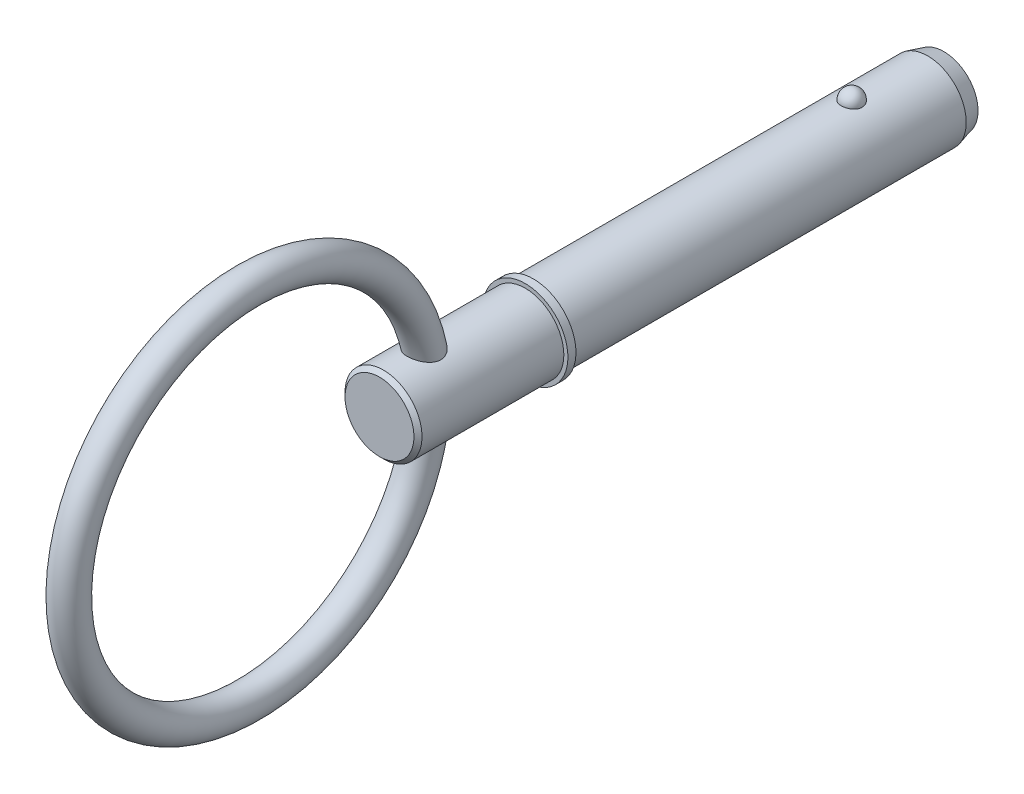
from build123d import *

# Parameters (mm, degrees)
SKETCH2_R           = 4.765
BOSS_EXTRUDE1_DEPTH = 38.1
BOSS_EXTRUDE2_START = 12.7
SKETCH3_R           = 4.765
BOSS_EXTRUDE2_DEPTH = 12.7
CHAMFER1_SIZE       = 2
CHAMFER1_SIZE2      = 0.535898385
SKETCH20_W          = 1
SKETCH20_H          = 5.265
SKETCH21_R          = 4.765
BOSS_EXTRUDE3_DEPTH = 19.05
CHAMFER2_SIZE       = 0.5
SKETCH24_R          = 2


with BuildPart() as part:
    # Sketch2 → Boss-Extrude1 (new body)
    with BuildSketch(Plane.XY):
        with Locations(Location((0, 0, 0), (0, 0, 180))):
            Circle(SKETCH2_R)
    extrude(amount=BOSS_EXTRUDE1_DEPTH)

    # Sketch3 → Boss-Extrude2 (add)
    with BuildSketch(Plane(origin=(0, 0, 0), x_dir=(-1, 0, 0), z_dir=(0, 0, -1)).offset(BOSS_EXTRUDE2_START)):
        Circle(SKETCH3_R)
    extrude(amount=-BOSS_EXTRUDE2_DEPTH)

    # Chamfer1
    chamfer1_edges = [part.edges().sort_by_distance(p)[0] for p in [
        (4.765, 0, -12.7),
    ]]
    chamfer1_side = [part.faces().sort_by_distance(p)[0] for p in [
        (4.765, 0, 12.7),
    ]]
    chamfer(chamfer1_edges, length=CHAMFER1_SIZE, length2=CHAMFER1_SIZE2, reference=chamfer1_side[0])

    # Sketch18 → Revolve1 (revolve)
    with BuildSketch(Plane(origin=(0, 0, 0), x_dir=(0, 0, -1), z_dir=(1, 0, 0))):
        with BuildLine():
            Line((1.29, 6.055), (1.29, 3.475))
            ThreePointArc((1.29, 3.475), (0, 4.765), (1.29, 6.055))
        make_face()
    revolve(axis=Axis((0, 6.055, -1.29), (0, -1, 0)))

    # Sketch20 → Revolve2 (revolve)
    with BuildSketch(Plane(origin=(0, 0, 0), x_dir=(0, 0, -1), z_dir=(1, 0, 0)), mode=Mode.PRIVATE) as revolve2_sk:
        with Locations((-38.6, 2.6325)):
            Rectangle(SKETCH20_W, SKETCH20_H)
    revolve(revolve2_sk.sketch.rotate(Axis((0, 0, 33.728787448), (0, 0, 1)), 90), axis=Axis((0, 0, 33.728787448), (0, 0, 1)))

    # Sketch21 → Boss-Extrude3 (add)
    with BuildSketch(Plane(origin=(0, 0, 38.1), x_dir=(-1, 0, 0), z_dir=(0, 0, -1))):
        Circle(SKETCH21_R)
    extrude(amount=-BOSS_EXTRUDE3_DEPTH)

    # Chamfer2
    chamfer2_edges = [part.edges().sort_by_distance(p)[0] for p in [
        (4.765, 0, 57.15),
    ]]
    chamfer(chamfer2_edges, length=CHAMFER2_SIZE)

    # Sweep1: sweep along a path in Sketch23
    with BuildLine(Plane(origin=(0, 0, 0), x_dir=(0, 0, -1), z_dir=(1, 0, 0))) as sweep1_path:
        CenterArc((-73.375, 0), 22.225, 0, 360)
    # Sketch24 → Sweep1 (sweep)
    with BuildSketch(Plane(origin=(0, 0, 0), x_dir=(1, 0, 0), z_dir=(0, 1, 0))):
        with Locations((0, -51.15)):
            Circle(SKETCH24_R)
    sweep(path=sweep1_path.line)


solid = part.part
